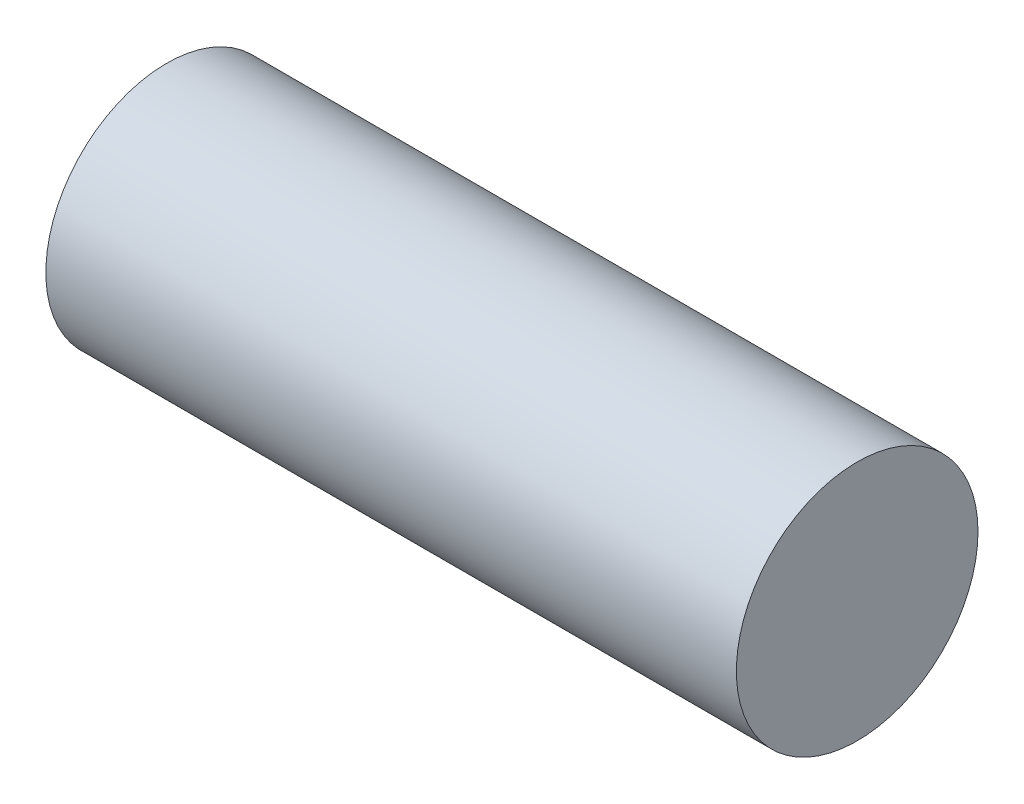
ISO-10303-21;
HEADER;
FILE_DESCRIPTION(('STEP AP214'),'2;1');
FILE_NAME('part.step','',(''),(''),'','','');
FILE_SCHEMA(('AUTOMOTIVE_DESIGN { 1 0 10303 214 1 1 1 1 }'));
ENDSEC;
DATA;
#1=APPLICATION_CONTEXT('core data for automotive mechanical design processes');
#2=APPLICATION_PROTOCOL_DEFINITION('international standard','automotive_design',2000,#1);
#3=PRODUCT_CONTEXT('',#1,'mechanical');
#4=PRODUCT('Part','Part','',(#3));
#5=PRODUCT_RELATED_PRODUCT_CATEGORY('part','',(#4));
#6=PRODUCT_DEFINITION_FORMATION('','',#4);
#7=PRODUCT_DEFINITION_CONTEXT('part definition',#1,'design');
#8=PRODUCT_DEFINITION('design','',#6,#7);
#9=PRODUCT_DEFINITION_SHAPE('','',#8);
#10=(LENGTH_UNIT() NAMED_UNIT(*) SI_UNIT(.MILLI.,.METRE.));
#11=(NAMED_UNIT(*) PLANE_ANGLE_UNIT() SI_UNIT($,.RADIAN.));
#12=(NAMED_UNIT(*) SI_UNIT($,.STERADIAN.) SOLID_ANGLE_UNIT());
#13=UNCERTAINTY_MEASURE_WITH_UNIT(LENGTH_MEASURE(1.E-05),#10,'distance_accuracy_value','');
#14=(GEOMETRIC_REPRESENTATION_CONTEXT(3) GLOBAL_UNCERTAINTY_ASSIGNED_CONTEXT((#13)) GLOBAL_UNIT_ASSIGNED_CONTEXT((#10,
#11,#12)) REPRESENTATION_CONTEXT('',''));
#15=CARTESIAN_POINT('',(0.,0.,0.));
#16=DIRECTION('',(0.,0.,1.));
#17=DIRECTION('',(1.,0.,0.));
#18=AXIS2_PLACEMENT_3D('',#15,#16,#17);
#19=CARTESIAN_POINT('',(28.58,0.,0.));
#20=DIRECTION('',(-1.,0.,0.));
#21=DIRECTION('',(0.,0.,1.));
#22=AXIS2_PLACEMENT_3D('',#19,#20,#21);
#23=CYLINDRICAL_SURFACE('',#22,5.);
#24=CARTESIAN_POINT('',(28.58,0.,0.));
#25=DIRECTION('',(1.,0.,0.));
#26=DIRECTION('',(0.,0.,-1.));
#27=AXIS2_PLACEMENT_3D('',#24,#25,#26);
#28=CIRCLE('',#27,5.);
#29=CARTESIAN_POINT('',(28.58,0.,-5.));
#30=VERTEX_POINT('',#29);
#31=EDGE_CURVE('E10',#30,#30,#28,.T.);
#32=ORIENTED_EDGE('',*,*,#31,.F.);
#33=EDGE_LOOP('',(#32));
#34=FACE_BOUND('',#33,.T.);
#35=CARTESIAN_POINT('',(0.,0.,0.));
#36=DIRECTION('',(1.,0.,0.));
#37=DIRECTION('',(0.,0.,-1.));
#38=AXIS2_PLACEMENT_3D('',#35,#36,#37);
#39=CIRCLE('',#38,5.);
#40=CARTESIAN_POINT('',(0.,0.,-5.));
#41=VERTEX_POINT('',#40);
#42=EDGE_CURVE('E48',#41,#41,#39,.T.);
#43=ORIENTED_EDGE('',*,*,#42,.T.);
#44=EDGE_LOOP('',(#43));
#45=FACE_BOUND('',#44,.T.);
#46=ADVANCED_FACE('F45',(#34,#45),#23,.T.);
#47=CARTESIAN_POINT('',(28.58,0.,0.));
#48=DIRECTION('',(1.,0.,0.));
#49=DIRECTION('',(0.,0.,-1.));
#50=AXIS2_PLACEMENT_3D('',#47,#48,#49);
#51=PLANE('',#50);
#52=ORIENTED_EDGE('',*,*,#31,.T.);
#53=EDGE_LOOP('',(#52));
#54=FACE_BOUND('',#53,.T.);
#55=ADVANCED_FACE('F64',(#54),#51,.T.);
#56=CARTESIAN_POINT('',(0.,0.,0.));
#57=DIRECTION('',(1.,0.,0.));
#58=DIRECTION('',(0.,0.,-1.));
#59=AXIS2_PLACEMENT_3D('',#56,#57,#58);
#60=PLANE('',#59);
#61=ORIENTED_EDGE('',*,*,#42,.F.);
#62=EDGE_LOOP('',(#61));
#63=FACE_BOUND('',#62,.T.);
#64=ADVANCED_FACE('F62',(#63),#60,.F.);
#65=CLOSED_SHELL('',(#46,#55,#64));
#66=MANIFOLD_SOLID_BREP('B2',#65);
#67=ADVANCED_BREP_SHAPE_REPRESENTATION('',(#18,#66),#14);
#68=SHAPE_DEFINITION_REPRESENTATION(#9,#67);
ENDSEC;
END-ISO-10303-21;
